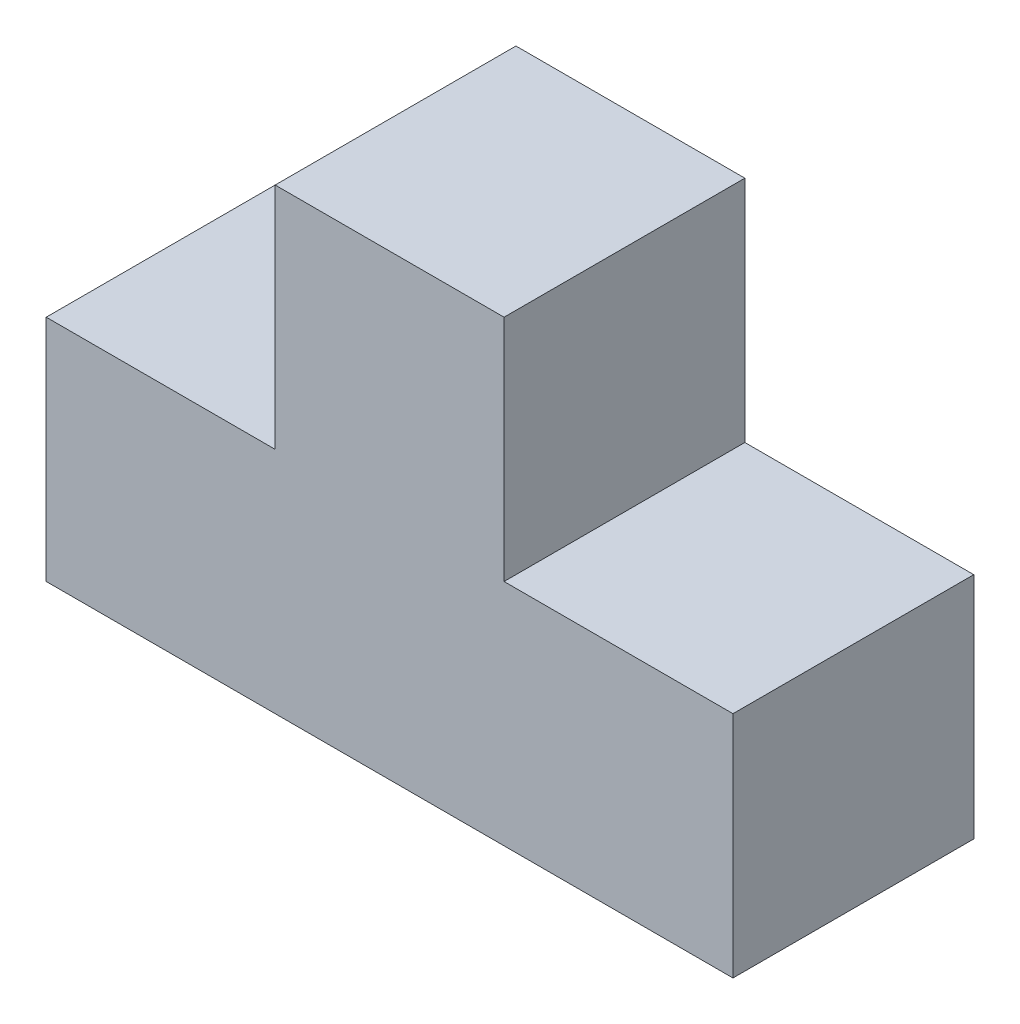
ISO-10303-21;
HEADER;
FILE_DESCRIPTION(('STEP AP214'),'2;1');
FILE_NAME('part.step','',(''),(''),'','','');
FILE_SCHEMA(('AUTOMOTIVE_DESIGN { 1 0 10303 214 1 1 1 1 }'));
ENDSEC;
DATA;
#1=APPLICATION_CONTEXT('core data for automotive mechanical design processes');
#2=APPLICATION_PROTOCOL_DEFINITION('international standard','automotive_design',2000,#1);
#3=PRODUCT_CONTEXT('',#1,'mechanical');
#4=PRODUCT('Part','Part','',(#3));
#5=PRODUCT_RELATED_PRODUCT_CATEGORY('part','',(#4));
#6=PRODUCT_DEFINITION_FORMATION('','',#4);
#7=PRODUCT_DEFINITION_CONTEXT('part definition',#1,'design');
#8=PRODUCT_DEFINITION('design','',#6,#7);
#9=PRODUCT_DEFINITION_SHAPE('','',#8);
#10=(LENGTH_UNIT() NAMED_UNIT(*) SI_UNIT(.MILLI.,.METRE.));
#11=(NAMED_UNIT(*) PLANE_ANGLE_UNIT() SI_UNIT($,.RADIAN.));
#12=(NAMED_UNIT(*) SI_UNIT($,.STERADIAN.) SOLID_ANGLE_UNIT());
#13=UNCERTAINTY_MEASURE_WITH_UNIT(LENGTH_MEASURE(1.E-05),#10,'distance_accuracy_value','');
#14=(GEOMETRIC_REPRESENTATION_CONTEXT(3) GLOBAL_UNCERTAINTY_ASSIGNED_CONTEXT((#13)) GLOBAL_UNIT_ASSIGNED_CONTEXT((#10,
#11,#12)) REPRESENTATION_CONTEXT('',''));
#15=CARTESIAN_POINT('',(0.,0.,0.));
#16=DIRECTION('',(0.,0.,1.));
#17=DIRECTION('',(1.,0.,0.));
#18=AXIS2_PLACEMENT_3D('',#15,#16,#17);
#19=CARTESIAN_POINT('',(71.7550540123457,0.,38.1));
#20=DIRECTION('',(0.,1.,0.));
#21=DIRECTION('',(0.,0.,1.));
#22=AXIS2_PLACEMENT_3D('',#19,#20,#21);
#23=PLANE('',#22);
#24=DIRECTION('',(1.,0.,0.));
#25=VECTOR('',#24,1.);
#26=CARTESIAN_POINT('',(71.7550540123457,0.,0.));
#27=LINE('',#26,#25);
#28=CARTESIAN_POINT('',(-36.9075038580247,0.,0.));
#29=VERTEX_POINT('',#28);
#30=CARTESIAN_POINT('',(71.7550540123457,0.,0.));
#31=VERTEX_POINT('',#30);
#32=EDGE_CURVE('E127',#29,#31,#27,.T.);
#33=ORIENTED_EDGE('',*,*,#32,.T.);
#34=DIRECTION('',(0.,0.,-1.));
#35=VECTOR('',#34,1.);
#36=CARTESIAN_POINT('',(71.7550540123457,0.,38.1));
#37=LINE('',#36,#35);
#38=CARTESIAN_POINT('',(71.7550540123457,0.,38.1));
#39=VERTEX_POINT('',#38);
#40=EDGE_CURVE('E11',#39,#31,#37,.T.);
#41=ORIENTED_EDGE('',*,*,#40,.F.);
#42=DIRECTION('',(1.,0.,0.));
#43=VECTOR('',#42,1.);
#44=CARTESIAN_POINT('',(71.7550540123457,0.,38.1));
#45=LINE('',#44,#43);
#46=CARTESIAN_POINT('',(-36.9075038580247,0.,38.1));
#47=VERTEX_POINT('',#46);
#48=EDGE_CURVE('E141',#47,#39,#45,.T.);
#49=ORIENTED_EDGE('',*,*,#48,.F.);
#50=DIRECTION('',(0.,0.,-1.));
#51=VECTOR('',#50,1.);
#52=CARTESIAN_POINT('',(-36.9075038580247,0.,38.1));
#53=LINE('',#52,#51);
#54=EDGE_CURVE('E123',#47,#29,#53,.T.);
#55=ORIENTED_EDGE('',*,*,#54,.T.);
#56=EDGE_LOOP('',(#33,#41,#49,#55));
#57=FACE_BOUND('',#56,.T.);
#58=ADVANCED_FACE('F31',(#57),#23,.F.);
#59=CARTESIAN_POINT('',(71.7550540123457,36.2208526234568,38.1));
#60=DIRECTION('',(-1.,0.,0.));
#61=DIRECTION('',(0.,0.,1.));
#62=AXIS2_PLACEMENT_3D('',#59,#60,#61);
#63=PLANE('',#62);
#64=DIRECTION('',(0.,1.,0.));
#65=VECTOR('',#64,1.);
#66=CARTESIAN_POINT('',(71.7550540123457,36.2208526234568,0.));
#67=LINE('',#66,#65);
#68=CARTESIAN_POINT('',(71.7550540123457,36.2208526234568,0.));
#69=VERTEX_POINT('',#68);
#70=EDGE_CURVE('E130',#31,#69,#67,.T.);
#71=ORIENTED_EDGE('',*,*,#70,.T.);
#72=DIRECTION('',(0.,0.,-1.));
#73=VECTOR('',#72,1.);
#74=CARTESIAN_POINT('',(71.7550540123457,36.2208526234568,38.1));
#75=LINE('',#74,#73);
#76=CARTESIAN_POINT('',(71.7550540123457,36.2208526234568,38.1));
#77=VERTEX_POINT('',#76);
#78=EDGE_CURVE('E39',#77,#69,#75,.T.);
#79=ORIENTED_EDGE('',*,*,#78,.F.);
#80=DIRECTION('',(0.,1.,0.));
#81=VECTOR('',#80,1.);
#82=CARTESIAN_POINT('',(71.7550540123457,36.2208526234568,38.1));
#83=LINE('',#82,#81);
#84=EDGE_CURVE('E90',#39,#77,#83,.T.);
#85=ORIENTED_EDGE('',*,*,#84,.F.);
#86=ORIENTED_EDGE('',*,*,#40,.T.);
#87=EDGE_LOOP('',(#71,#79,#85,#86));
#88=FACE_BOUND('',#87,.T.);
#89=ADVANCED_FACE('F176',(#88),#63,.F.);
#90=CARTESIAN_POINT('',(35.5342013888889,36.2208526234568,38.1));
#91=DIRECTION('',(0.,-1.,0.));
#92=DIRECTION('',(0.,0.,-1.));
#93=AXIS2_PLACEMENT_3D('',#90,#91,#92);
#94=PLANE('',#93);
#95=DIRECTION('',(-1.,0.,0.));
#96=VECTOR('',#95,1.);
#97=CARTESIAN_POINT('',(35.5342013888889,36.2208526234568,0.));
#98=LINE('',#97,#96);
#99=CARTESIAN_POINT('',(35.5342013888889,36.2208526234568,0.));
#100=VERTEX_POINT('',#99);
#101=EDGE_CURVE('E132',#69,#100,#98,.T.);
#102=ORIENTED_EDGE('',*,*,#101,.T.);
#103=DIRECTION('',(0.,0.,-1.));
#104=VECTOR('',#103,1.);
#105=CARTESIAN_POINT('',(35.5342013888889,36.2208526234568,38.1));
#106=LINE('',#105,#104);
#107=CARTESIAN_POINT('',(35.5342013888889,36.2208526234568,38.1));
#108=VERTEX_POINT('',#107);
#109=EDGE_CURVE('E148',#108,#100,#106,.T.);
#110=ORIENTED_EDGE('',*,*,#109,.F.);
#111=DIRECTION('',(-1.,0.,0.));
#112=VECTOR('',#111,1.);
#113=CARTESIAN_POINT('',(35.5342013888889,36.2208526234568,38.1));
#114=LINE('',#113,#112);
#115=EDGE_CURVE('E156',#77,#108,#114,.T.);
#116=ORIENTED_EDGE('',*,*,#115,.F.);
#117=ORIENTED_EDGE('',*,*,#78,.T.);
#118=EDGE_LOOP('',(#102,#110,#116,#117));
#119=FACE_BOUND('',#118,.T.);
#120=ADVANCED_FACE('F154',(#119),#94,.F.);
#121=CARTESIAN_POINT('',(35.5342013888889,72.4417052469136,38.1));
#122=DIRECTION('',(-1.,0.,0.));
#123=DIRECTION('',(0.,0.,1.));
#124=AXIS2_PLACEMENT_3D('',#121,#122,#123);
#125=PLANE('',#124);
#126=DIRECTION('',(0.,1.,0.));
#127=VECTOR('',#126,1.);
#128=CARTESIAN_POINT('',(35.5342013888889,72.4417052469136,0.));
#129=LINE('',#128,#127);
#130=CARTESIAN_POINT('',(35.5342013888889,72.4417052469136,0.));
#131=VERTEX_POINT('',#130);
#132=EDGE_CURVE('E134',#100,#131,#129,.T.);
#133=ORIENTED_EDGE('',*,*,#132,.T.);
#134=DIRECTION('',(0.,0.,-1.));
#135=VECTOR('',#134,1.);
#136=CARTESIAN_POINT('',(35.5342013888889,72.4417052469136,38.1));
#137=LINE('',#136,#135);
#138=CARTESIAN_POINT('',(35.5342013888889,72.4417052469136,38.1));
#139=VERTEX_POINT('',#138);
#140=EDGE_CURVE('E145',#139,#131,#137,.T.);
#141=ORIENTED_EDGE('',*,*,#140,.F.);
#142=DIRECTION('',(0.,1.,0.));
#143=VECTOR('',#142,1.);
#144=CARTESIAN_POINT('',(35.5342013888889,72.4417052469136,38.1));
#145=LINE('',#144,#143);
#146=EDGE_CURVE('E168',#108,#139,#145,.T.);
#147=ORIENTED_EDGE('',*,*,#146,.F.);
#148=ORIENTED_EDGE('',*,*,#109,.T.);
#149=EDGE_LOOP('',(#133,#141,#147,#148));
#150=FACE_BOUND('',#149,.T.);
#151=ADVANCED_FACE('F164',(#150),#125,.F.);
#152=CARTESIAN_POINT('',(-0.686651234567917,72.4417052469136,38.1));
#153=DIRECTION('',(0.,-1.,0.));
#154=DIRECTION('',(0.,0.,-1.));
#155=AXIS2_PLACEMENT_3D('',#152,#153,#154);
#156=PLANE('',#155);
#157=DIRECTION('',(-1.,0.,0.));
#158=VECTOR('',#157,1.);
#159=CARTESIAN_POINT('',(-0.686651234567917,72.4417052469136,0.));
#160=LINE('',#159,#158);
#161=CARTESIAN_POINT('',(-0.686651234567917,72.4417052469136,0.));
#162=VERTEX_POINT('',#161);
#163=EDGE_CURVE('E136',#131,#162,#160,.T.);
#164=ORIENTED_EDGE('',*,*,#163,.T.);
#165=DIRECTION('',(0.,0.,-1.));
#166=VECTOR('',#165,1.);
#167=CARTESIAN_POINT('',(-0.686651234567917,72.4417052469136,38.1));
#168=LINE('',#167,#166);
#169=CARTESIAN_POINT('',(-0.686651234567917,72.4417052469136,38.1));
#170=VERTEX_POINT('',#169);
#171=EDGE_CURVE('E118',#170,#162,#168,.T.);
#172=ORIENTED_EDGE('',*,*,#171,.F.);
#173=DIRECTION('',(-1.,0.,0.));
#174=VECTOR('',#173,1.);
#175=CARTESIAN_POINT('',(-0.686651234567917,72.4417052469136,38.1));
#176=LINE('',#175,#174);
#177=EDGE_CURVE('E109',#139,#170,#176,.T.);
#178=ORIENTED_EDGE('',*,*,#177,.F.);
#179=ORIENTED_EDGE('',*,*,#140,.T.);
#180=EDGE_LOOP('',(#164,#172,#178,#179));
#181=FACE_BOUND('',#180,.T.);
#182=ADVANCED_FACE('F167',(#181),#156,.F.);
#183=CARTESIAN_POINT('',(-0.686651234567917,36.2208526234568,38.1));
#184=DIRECTION('',(1.,0.,0.));
#185=DIRECTION('',(0.,0.,-1.));
#186=AXIS2_PLACEMENT_3D('',#183,#184,#185);
#187=PLANE('',#186);
#188=DIRECTION('',(0.,-1.,0.));
#189=VECTOR('',#188,1.);
#190=CARTESIAN_POINT('',(-0.686651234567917,36.2208526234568,0.));
#191=LINE('',#190,#189);
#192=CARTESIAN_POINT('',(-0.686651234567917,36.2208526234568,0.));
#193=VERTEX_POINT('',#192);
#194=EDGE_CURVE('E117',#162,#193,#191,.T.);
#195=ORIENTED_EDGE('',*,*,#194,.T.);
#196=DIRECTION('',(0.,0.,-1.));
#197=VECTOR('',#196,1.);
#198=CARTESIAN_POINT('',(-0.686651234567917,36.2208526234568,38.1));
#199=LINE('',#198,#197);
#200=CARTESIAN_POINT('',(-0.686651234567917,36.2208526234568,38.1));
#201=VERTEX_POINT('',#200);
#202=EDGE_CURVE('E114',#201,#193,#199,.T.);
#203=ORIENTED_EDGE('',*,*,#202,.F.);
#204=DIRECTION('',(0.,-1.,0.));
#205=VECTOR('',#204,1.);
#206=CARTESIAN_POINT('',(-0.686651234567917,36.2208526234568,38.1));
#207=LINE('',#206,#205);
#208=EDGE_CURVE('E103',#170,#201,#207,.T.);
#209=ORIENTED_EDGE('',*,*,#208,.F.);
#210=ORIENTED_EDGE('',*,*,#171,.T.);
#211=EDGE_LOOP('',(#195,#203,#209,#210));
#212=FACE_BOUND('',#211,.T.);
#213=ADVANCED_FACE('F115',(#212),#187,.F.);
#214=CARTESIAN_POINT('',(-36.9075038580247,36.2208526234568,38.1));
#215=DIRECTION('',(0.,-1.,0.));
#216=DIRECTION('',(0.,0.,-1.));
#217=AXIS2_PLACEMENT_3D('',#214,#215,#216);
#218=PLANE('',#217);
#219=DIRECTION('',(-1.,0.,0.));
#220=VECTOR('',#219,1.);
#221=CARTESIAN_POINT('',(-36.9075038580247,36.2208526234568,0.));
#222=LINE('',#221,#220);
#223=CARTESIAN_POINT('',(-36.9075038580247,36.2208526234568,0.));
#224=VERTEX_POINT('',#223);
#225=EDGE_CURVE('E76',#193,#224,#222,.T.);
#226=ORIENTED_EDGE('',*,*,#225,.T.);
#227=DIRECTION('',(0.,0.,-1.));
#228=VECTOR('',#227,1.);
#229=CARTESIAN_POINT('',(-36.9075038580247,36.2208526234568,38.1));
#230=LINE('',#229,#228);
#231=CARTESIAN_POINT('',(-36.9075038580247,36.2208526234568,38.1));
#232=VERTEX_POINT('',#231);
#233=EDGE_CURVE('E119',#232,#224,#230,.T.);
#234=ORIENTED_EDGE('',*,*,#233,.F.);
#235=DIRECTION('',(-1.,0.,0.));
#236=VECTOR('',#235,1.);
#237=CARTESIAN_POINT('',(-36.9075038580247,36.2208526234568,38.1));
#238=LINE('',#237,#236);
#239=EDGE_CURVE('E107',#201,#232,#238,.T.);
#240=ORIENTED_EDGE('',*,*,#239,.F.);
#241=ORIENTED_EDGE('',*,*,#202,.T.);
#242=EDGE_LOOP('',(#226,#234,#240,#241));
#243=FACE_BOUND('',#242,.T.);
#244=ADVANCED_FACE('F121',(#243),#218,.F.);
#245=CARTESIAN_POINT('',(-36.9075038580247,0.,38.1));
#246=DIRECTION('',(1.,0.,0.));
#247=DIRECTION('',(0.,0.,-1.));
#248=AXIS2_PLACEMENT_3D('',#245,#246,#247);
#249=PLANE('',#248);
#250=DIRECTION('',(0.,-1.,0.));
#251=VECTOR('',#250,1.);
#252=CARTESIAN_POINT('',(-36.9075038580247,0.,0.));
#253=LINE('',#252,#251);
#254=EDGE_CURVE('E82',#224,#29,#253,.T.);
#255=ORIENTED_EDGE('',*,*,#254,.T.);
#256=ORIENTED_EDGE('',*,*,#54,.F.);
#257=DIRECTION('',(0.,-1.,0.));
#258=VECTOR('',#257,1.);
#259=CARTESIAN_POINT('',(-36.9075038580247,0.,38.1));
#260=LINE('',#259,#258);
#261=EDGE_CURVE('E47',#232,#47,#260,.T.);
#262=ORIENTED_EDGE('',*,*,#261,.F.);
#263=ORIENTED_EDGE('',*,*,#233,.T.);
#264=EDGE_LOOP('',(#255,#256,#262,#263));
#265=FACE_BOUND('',#264,.T.);
#266=ADVANCED_FACE('F192',(#265),#249,.F.);
#267=CARTESIAN_POINT('',(-36.9075038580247,0.,38.1));
#268=DIRECTION('',(0.,0.,-1.));
#269=DIRECTION('',(-1.,0.,0.));
#270=AXIS2_PLACEMENT_3D('',#267,#268,#269);
#271=PLANE('',#270);
#272=ORIENTED_EDGE('',*,*,#48,.T.);
#273=ORIENTED_EDGE('',*,*,#84,.T.);
#274=ORIENTED_EDGE('',*,*,#115,.T.);
#275=ORIENTED_EDGE('',*,*,#146,.T.);
#276=ORIENTED_EDGE('',*,*,#177,.T.);
#277=ORIENTED_EDGE('',*,*,#208,.T.);
#278=ORIENTED_EDGE('',*,*,#239,.T.);
#279=ORIENTED_EDGE('',*,*,#261,.T.);
#280=EDGE_LOOP('',(#272,#273,#274,#275,#276,#277,#278,#279));
#281=FACE_BOUND('',#280,.T.);
#282=ADVANCED_FACE('F105',(#281),#271,.F.);
#283=CARTESIAN_POINT('',(-36.9075038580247,0.,0.));
#284=DIRECTION('',(0.,0.,-1.));
#285=DIRECTION('',(-1.,0.,0.));
#286=AXIS2_PLACEMENT_3D('',#283,#284,#285);
#287=PLANE('',#286);
#288=ORIENTED_EDGE('',*,*,#32,.F.);
#289=ORIENTED_EDGE('',*,*,#254,.F.);
#290=ORIENTED_EDGE('',*,*,#225,.F.);
#291=ORIENTED_EDGE('',*,*,#194,.F.);
#292=ORIENTED_EDGE('',*,*,#163,.F.);
#293=ORIENTED_EDGE('',*,*,#132,.F.);
#294=ORIENTED_EDGE('',*,*,#101,.F.);
#295=ORIENTED_EDGE('',*,*,#70,.F.);
#296=EDGE_LOOP('',(#288,#289,#290,#291,#292,#293,#294,#295));
#297=FACE_BOUND('',#296,.T.);
#298=ADVANCED_FACE('F160',(#297),#287,.T.);
#299=CLOSED_SHELL('',(#58,#89,#120,#151,#182,#213,#244,#266,#282,#298));
#300=MANIFOLD_SOLID_BREP('B2',#299);
#301=ADVANCED_BREP_SHAPE_REPRESENTATION('',(#18,#300),#14);
#302=SHAPE_DEFINITION_REPRESENTATION(#9,#301);
ENDSEC;
END-ISO-10303-21;
